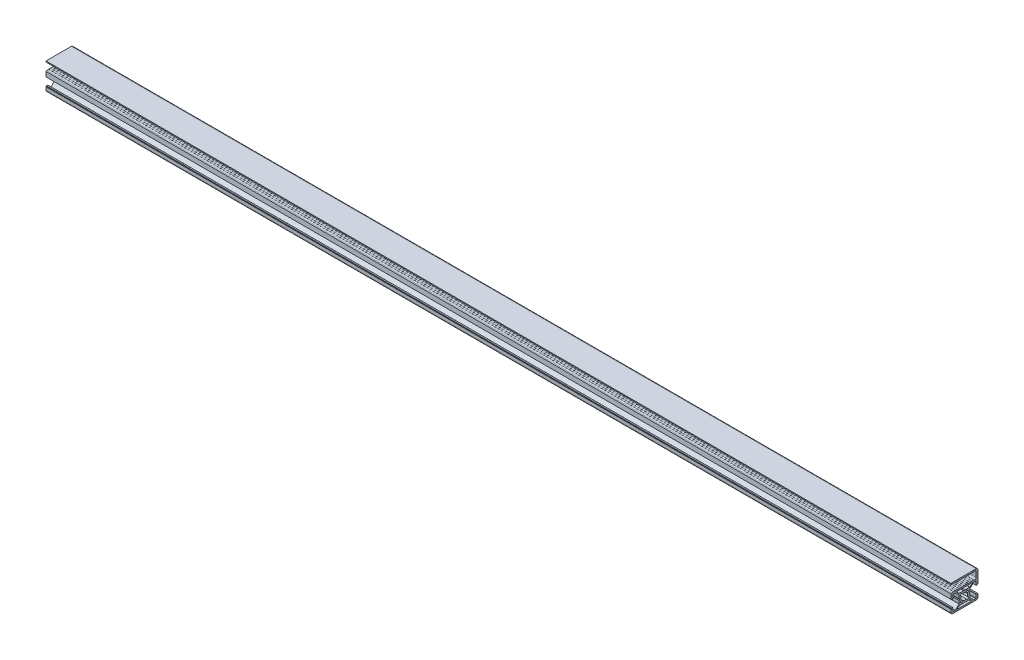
from build123d import *

# Parameters (mm, degrees)
STRUKTURBAUTEIL1_DEPTH = 1000


with BuildPart() as part:
    # Model → Strukturbauteil1 (new body)
    with BuildSketch(Plane(origin=(0, 0, 0), x_dir=(0, 0, -1), z_dir=(1, 0, 0))):
        with BuildLine():
            Line((-15.000004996, 15.000004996), (-15.000004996, 13.900004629))
            Line((-15.000004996, 13.900004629), (-14.000004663, 13.505593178))
            Line((-14.000004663, 13.505593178), (-12.182885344, 13.202725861))
            ThreePointArc((-12.182885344, 13.202725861), (-12.064426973, 13.219237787), (-11.976573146, 13.300396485))
            Line((-11.976573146, 13.300396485), (-11.966223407, 13.319612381))
            ThreePointArc((-11.966223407, 13.319612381), (-11.881055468, 13.399474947), (-11.765808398, 13.418175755))
            Line((-11.765808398, 13.418175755), (-10.176987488, 13.201833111))
            ThreePointArc((-10.176987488, 13.201833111), (-10.061740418, 13.220533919), (-9.976572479, 13.300396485))
            Line((-9.976572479, 13.300396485), (-9.966222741, 13.319612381))
            ThreePointArc((-9.966222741, 13.319612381), (-9.881054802, 13.399474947), (-9.765807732, 13.418175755))
            Line((-9.765807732, 13.418175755), (-8.176986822, 13.201833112))
            ThreePointArc((-8.176986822, 13.201833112), (-8.061739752, 13.220533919), (-7.976571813, 13.300396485))
            Line((-7.976571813, 13.300396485), (-7.966222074, 13.319612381))
            ThreePointArc((-7.966222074, 13.319612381), (-7.881054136, 13.399474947), (-7.765807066, 13.418175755))
            Line((-7.765807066, 13.418175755), (-6.176986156, 13.201833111))
            ThreePointArc((-6.176986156, 13.201833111), (-6.061739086, 13.220533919), (-5.976571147, 13.300396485))
            Line((-5.976571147, 13.300396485), (-5.966221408, 13.319612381))
            ThreePointArc((-5.966221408, 13.319612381), (-5.881053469, 13.399474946), (-5.765806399, 13.418175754))
            Line((-5.765806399, 13.418175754), (-4.17698549, 13.201833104))
            ThreePointArc((-4.17698549, 13.201833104), (-4.06173842, 13.220533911), (-3.976570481, 13.300396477))
            Line((-3.976570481, 13.300396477), (-3.966220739, 13.319612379))
            ThreePointArc((-3.966220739, 13.319612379), (-3.881052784, 13.399474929), (-3.765805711, 13.418175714))
            Line((-3.765805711, 13.418175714), (-2.176984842, 13.201832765))
            ThreePointArc((-2.176984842, 13.201832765), (-2.061737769, 13.22053355), (-1.976569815, 13.3003961))
            Line((-1.976569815, 13.3003961), (-1.966219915, 13.319612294))
            ThreePointArc((-1.966219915, 13.319612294), (-1.881051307, 13.399474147), (-1.765804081, 13.418173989))
            Line((-1.765804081, 13.418173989), (-0.176984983, 13.201818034))
            ThreePointArc((-0.176984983, 13.201818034), (-0.061737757, 13.220517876), (0.023430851, 13.300379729))
            Line((0.023430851, 13.300379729), (0.03378059, 13.319612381))
            ThreePointArc((0.03378059, 13.319612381), (0.118948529, 13.399474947), (0.234195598, 13.418175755))
            Line((0.234195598, 13.418175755), (1.823016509, 13.201833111))
            ThreePointArc((1.823016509, 13.201833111), (1.938263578, 13.220533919), (2.023431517, 13.300396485))
            Line((2.023431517, 13.300396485), (2.033781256, 13.319612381))
            ThreePointArc((2.033781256, 13.319612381), (2.118949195, 13.399474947), (2.234196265, 13.418175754))
            Line((2.234196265, 13.418175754), (3.823017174, 13.201833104))
            ThreePointArc((3.823017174, 13.201833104), (3.938264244, 13.220533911), (4.023432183, 13.300396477))
            Line((4.023432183, 13.300396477), (4.033781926, 13.319612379))
            ThreePointArc((4.033781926, 13.319612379), (4.11894988, 13.399474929), (4.234196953, 13.418175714))
            Line((4.234196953, 13.418175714), (5.823017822, 13.201832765))
            ThreePointArc((5.823017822, 13.201832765), (5.938264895, 13.220533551), (6.023432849, 13.300396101))
            Line((6.023432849, 13.300396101), (6.033782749, 13.319612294))
            ThreePointArc((6.033782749, 13.319612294), (6.118951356, 13.399474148), (6.234198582, 13.418173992))
            Line((6.234198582, 13.418173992), (7.823017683, 13.201818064))
            ThreePointArc((7.823017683, 13.201818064), (7.936103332, 13.219470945), (8.020991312, 13.296243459))
            Line((8.020991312, 13.296243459), (8.031825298, 13.315207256))
            ThreePointArc((8.031825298, 13.315207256), (8.108230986, 13.384055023), (8.209762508, 13.400462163))
            Line((8.209762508, 13.400462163), (9.774792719, 13.201599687))
            ThreePointArc((9.774792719, 13.201599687), (9.932211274, 13.249934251), (10.000003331, 13.400004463))
            Line((10.000003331, 13.400004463), (10.000003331, 13.700004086))
            Line((10.000003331, 13.700004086), (11.300005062, 13.700004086))
            ThreePointArc((11.300005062, 13.700004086), (12.360665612, 13.260664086), (12.800005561, 12.200003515))
            Line((12.800005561, 12.200003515), (12.800005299, 6.700001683))
            ThreePointArc((12.800005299, 6.700001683), (12.360665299, 5.639341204), (11.300004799, 5.200001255))
            Line((11.300004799, 5.200001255), (10.000004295, 5.200001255))
            Line((10.000004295, 5.200001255), (10.000004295, 5.500001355))
            ThreePointArc((10.000004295, 5.500001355), (9.932212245, 5.65007157), (9.774793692, 5.698406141))
            Line((9.774793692, 5.698406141), (8.209763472, 5.49954374))
            ThreePointArc((8.209763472, 5.49954374), (8.108231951, 5.515950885), (8.031826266, 5.584798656))
            Line((8.031826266, 5.584798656), (8.020992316, 5.60374575))
            ThreePointArc((8.020992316, 5.60374575), (7.936104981, 5.680518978), (7.823019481, 5.69817281))
            Line((7.823019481, 5.69817281), (6.23419856, 5.481830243))
            ThreePointArc((6.23419856, 5.481830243), (6.118951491, 5.500531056), (6.033783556, 5.580393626))
            Line((6.033783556, 5.580393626), (6.023433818, 5.599609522))
            ThreePointArc((6.023433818, 5.599609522), (5.938265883, 5.679472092), (5.823018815, 5.698172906))
            Line((5.823018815, 5.698172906), (4.234197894, 5.481830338))
            ThreePointArc((4.234197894, 5.481830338), (4.118950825, 5.500531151), (4.03378289, 5.580393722))
            Line((4.03378289, 5.580393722), (4.023433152, 5.599609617))
            ThreePointArc((4.023433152, 5.599609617), (3.938265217, 5.679472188), (3.823018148, 5.698173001))
            Line((3.823018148, 5.698173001), (2.234197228, 5.481830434))
            ThreePointArc((2.234197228, 5.481830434), (2.118950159, 5.500531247), (2.033782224, 5.580393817))
            Line((2.033782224, 5.580393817), (2.023432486, 5.599609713))
            ThreePointArc((2.023432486, 5.599609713), (1.938264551, 5.679472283), (1.823017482, 5.698173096))
            Line((1.823017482, 5.698173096), (0.234196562, 5.481830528))
            ThreePointArc((0.234196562, 5.481830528), (0.118949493, 5.500531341), (0.033781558, 5.580393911))
            Line((0.033781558, 5.580393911), (0.023431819, 5.599609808))
            ThreePointArc((0.023431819, 5.599609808), (-0.061736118, 5.679472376), (-0.176983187, 5.698173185))
            Line((-0.176983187, 5.698173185), (-1.765804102, 5.48183057))
            ThreePointArc((-1.765804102, 5.48183057), (-1.881051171, 5.500531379), (-1.966219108, 5.580393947))
            Line((-1.966219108, 5.580393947), (-1.976568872, 5.59960989))
            ThreePointArc((-1.976568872, 5.59960989), (-2.061736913, 5.679472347), (-2.176984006, 5.698173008))
            Line((-2.176984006, 5.698173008), (-3.76580464, 5.481828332))
            ThreePointArc((-3.76580464, 5.481828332), (-3.881051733, 5.500528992), (-3.966219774, 5.580391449))
            Line((-3.966219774, 5.580391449), (-3.97657062, 5.599609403))
            ThreePointArc((-3.97657062, 5.599609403), (-4.06174316, 5.679467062), (-4.176991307, 5.69816123))
            Line((-4.176991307, 5.69816123), (-5.76579975, 5.481727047))
            ThreePointArc((-5.76579975, 5.481727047), (-5.881047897, 5.500421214), (-5.966220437, 5.580278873))
            Line((-5.966220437, 5.580278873), (-5.976570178, 5.599610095))
            ThreePointArc((-5.976570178, 5.599610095), (-6.061738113, 5.679472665), (-6.176985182, 5.698173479))
            Line((-6.176985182, 5.698173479), (-7.765806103, 5.481830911))
            ThreePointArc((-7.765806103, 5.481830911), (-7.881053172, 5.500531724), (-7.966221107, 5.580394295))
            Line((-7.966221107, 5.580394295), (-7.976570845, 5.599610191))
            ThreePointArc((-7.976570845, 5.599610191), (-8.061738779, 5.679472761), (-8.176985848, 5.698173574))
            Line((-8.176985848, 5.698173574), (-9.765806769, 5.481831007))
            ThreePointArc((-9.765806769, 5.481831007), (-9.881053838, 5.50053182), (-9.966221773, 5.58039439))
            Line((-9.966221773, 5.58039439), (-9.976571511, 5.599610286))
            ThreePointArc((-9.976571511, 5.599610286), (-10.061739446, 5.679472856), (-10.176986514, 5.698173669))
            Line((-10.176986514, 5.698173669), (-11.765807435, 5.4818311))
            ThreePointArc((-11.765807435, 5.4818311), (-11.881054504, 5.500531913), (-11.966222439, 5.580394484))
            Line((-11.966222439, 5.580394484), (-11.976572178, 5.599610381))
            ThreePointArc((-11.976572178, 5.599610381), (-12.064426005, 5.68076908), (-12.182884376, 5.697281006))
            Line((-12.182884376, 5.697281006), (-14.000003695, 5.394413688))
            Line((-14.000003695, 5.394413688), (-15.000004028, 5.000002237))
            Line((-15.000004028, 5.000002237), (-15.000004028, -0.299999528))
            Line((-15.000004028, -0.299999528), (-14.400003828, -0.299999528))
            Line((-14.400003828, -0.299999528), (-14.400003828, -0.899999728))
            Line((-14.400003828, -0.899999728), (-13.000003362, -0.899999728))
            ThreePointArc((-13.000003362, -0.899999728), (-12.858581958, -0.841421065), (-12.800003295, -0.699999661))
            Line((-12.800003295, -0.699999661), (-12.800003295, 3.150001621))
            ThreePointArc((-12.800003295, 3.150001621), (-12.741424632, 3.291423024), (-12.600003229, 3.350001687))
            Line((-12.600003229, 3.350001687), (-10.232845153, 3.350001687))
            ThreePointArc((-10.232845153, 3.350001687), (-10.156308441, 3.334777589), (-10.091423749, 3.291423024))
            Line((-10.091423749, 3.291423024), (-6.008579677, -0.791421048))
            ThreePointArc((-6.008579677, -0.791421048), (-5.965225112, -0.856305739), (-5.950001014, -0.932842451))
            Line((-5.950001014, -0.932842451), (-5.950001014, -4.139383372))
            Line((-5.950001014, -4.139383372), (-5.45312314, -5.000001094))
            Line((-5.45312314, -5.000001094), (-5.950001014, -5.860618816))
            Line((-5.950001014, -5.860618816), (-5.950001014, -9.067159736))
            ThreePointArc((-5.950001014, -9.067159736), (-5.965225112, -9.143696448), (-6.008579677, -9.208581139))
            Line((-6.008579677, -9.208581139), (-10.091423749, -13.291425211))
            ThreePointArc((-10.091423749, -13.291425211), (-10.156308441, -13.334779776), (-10.232845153, -13.350003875))
            Line((-10.232845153, -13.350003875), (-12.600003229, -13.350003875))
            ThreePointArc((-12.600003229, -13.350003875), (-12.741424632, -13.291425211), (-12.800003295, -13.150003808))
            Line((-12.800003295, -13.150003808), (-12.800003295, -9.300002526))
            ThreePointArc((-12.800003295, -9.300002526), (-12.858581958, -9.158581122), (-13.000003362, -9.100002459))
            Line((-13.000003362, -9.100002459), (-14.400003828, -9.100002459))
            Line((-14.400003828, -9.100002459), (-14.400003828, -9.700002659))
            Line((-14.400003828, -9.700002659), (-15.000004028, -9.700002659))
            Line((-15.000004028, -9.700002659), (-15.000004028, -13.000003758))
            ThreePointArc((-15.000004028, -13.000003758), (-14.414217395, -14.414217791), (-13.000003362, -15.000004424))
            Line((-13.000003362, -15.000004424), (13.000005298, -15.000004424))
            ThreePointArc((13.000005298, -15.000004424), (14.414219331, -14.414217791), (15.000005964, -13.000003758))
            Line((15.000005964, -13.000003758), (15.000005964, -9.700002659))
            Line((15.000005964, -9.700002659), (14.400005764, -9.700002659))
            Line((14.400005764, -9.700002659), (14.400005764, -9.100002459))
            Line((14.400005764, -9.100002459), (13.000005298, -9.100002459))
            ThreePointArc((13.000005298, -9.100002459), (12.858583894, -9.158581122), (12.800005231, -9.300002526))
            Line((12.800005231, -9.300002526), (12.800005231, -13.150003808))
            ThreePointArc((12.800005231, -13.150003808), (12.741426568, -13.291425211), (12.600005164, -13.350003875))
            Line((12.600005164, -13.350003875), (10.232847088, -13.350003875))
            ThreePointArc((10.232847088, -13.350003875), (10.156310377, -13.334779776), (10.091425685, -13.291425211))
            Line((10.091425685, -13.291425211), (6.008581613, -9.208581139))
            ThreePointArc((6.008581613, -9.208581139), (5.965227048, -9.143696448), (5.95000295, -9.067159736))
            Line((5.95000295, -9.067159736), (5.95000295, -5.860618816))
            Line((5.95000295, -5.860618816), (5.453125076, -5.000001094))
            Line((5.453125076, -5.000001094), (5.95000295, -4.139383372))
            Line((5.95000295, -4.139383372), (5.95000295, -0.932842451))
            ThreePointArc((5.95000295, -0.932842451), (5.965227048, -0.856305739), (6.008581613, -0.791421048))
            Line((6.008581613, -0.791421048), (10.091425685, 3.291423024))
            ThreePointArc((10.091425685, 3.291423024), (10.156310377, 3.334777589), (10.232847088, 3.350001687))
            Line((10.232847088, 3.350001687), (12.600005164, 3.350001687))
            ThreePointArc((12.600005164, 3.350001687), (12.741426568, 3.291423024), (12.800005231, 3.150001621))
            Line((12.800005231, 3.150001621), (12.800005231, -0.699999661))
            ThreePointArc((12.800005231, -0.699999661), (12.858583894, -0.841421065), (13.000005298, -0.899999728))
            Line((13.000005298, -0.899999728), (14.400005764, -0.899999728))
            Line((14.400005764, -0.899999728), (14.400005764, -0.299999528))
            Line((14.400005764, -0.299999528), (15.000004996, -0.299999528))
            Line((15.000004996, -0.299999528), (15.000004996, 13.00000433))
            ThreePointArc((15.000004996, 13.00000433), (14.414218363, 14.414218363), (13.00000433, 15.000004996))
            Line((13.00000433, 15.000004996), (-15.000004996, 15.000004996))
        make_face()
        with BuildLine():
            Line((-7.864037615, -13.350004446), (7.864037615, -13.350004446))
            ThreePointArc((7.864037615, -13.350004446), (8.048813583, -13.226541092), (8.005459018, -13.008582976))
            Line((8.005459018, -13.008582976), (6.008580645, -11.011704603))
            ThreePointArc((6.008580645, -11.011704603), (5.943695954, -10.968350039), (5.867159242, -10.95312594))
            Line((5.867159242, -10.95312594), (0.866025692, -10.95312594))
            Line((0.866025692, -10.95312594), (0, -10.453125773))
            Line((0, -10.453125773), (-0.866025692, -10.95312594))
            Line((-0.866025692, -10.95312594), (-5.867159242, -10.95312594))
            ThreePointArc((-5.867159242, -10.95312594), (-5.943695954, -10.968350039), (-6.008580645, -11.011704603))
            Line((-6.008580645, -11.011704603), (-8.005459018, -13.008582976))
            ThreePointArc((-8.005459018, -13.008582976), (-8.048813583, -13.226541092), (-7.864037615, -13.350004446))
        make_face(mode=Mode.SUBTRACT)
        with BuildLine():
            Line((-4.531372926, -1.882842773), (-3.18929438, -3.224921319))
            ThreePointArc((-3.18929438, -3.224921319), (-3.650001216, -5.000001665), (-3.18929438, -6.775082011))
            Line((-3.18929438, -6.775082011), (-4.531372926, -8.117160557))
            ThreePointArc((-4.531372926, -8.117160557), (-3.889088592, -8.889090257), (-3.117158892, -9.531374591))
            Line((-3.117158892, -9.531374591), (-1.775080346, -8.189296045))
            ThreePointArc((-1.775080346, -8.189296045), (0, -8.650002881), (1.775080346, -8.189296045))
            Line((1.775080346, -8.189296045), (3.117158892, -9.531374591))
            ThreePointArc((3.117158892, -9.531374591), (3.889088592, -8.889090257), (4.531372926, -8.117160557))
            Line((4.531372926, -8.117160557), (3.18929438, -6.775082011))
            ThreePointArc((3.18929438, -6.775082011), (3.650001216, -5.000001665), (3.18929438, -3.224921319))
            Line((3.18929438, -3.224921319), (4.531372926, -1.882842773))
            ThreePointArc((4.531372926, -1.882842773), (3.889088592, -1.110913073), (3.117158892, -0.46862874))
            Line((3.117158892, -0.46862874), (1.775080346, -1.810707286))
            ThreePointArc((1.775080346, -1.810707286), (0, -1.35000045), (-1.775080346, -1.810707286))
            Line((-1.775080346, -1.810707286), (-3.117158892, -0.46862874))
            ThreePointArc((-3.117158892, -0.46862874), (-3.889088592, -1.110913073), (-4.531372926, -1.882842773))
        make_face(mode=Mode.SUBTRACT)
        with BuildLine():
            Line((-8.601703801, 3.598579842), (-6.008580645, 1.005456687))
            ThreePointArc((-6.008580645, 1.005456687), (-5.943695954, 0.962102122), (-5.867159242, 0.946878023))
            Line((-5.867159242, 0.946878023), (-0.855209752, 0.946878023))
            Line((-0.855209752, 0.946878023), (0, 0.453122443))
            Line((0, 0.453122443), (0.855209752, 0.946878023))
            Line((0.855209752, 0.946878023), (5.867159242, 0.946878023))
            ThreePointArc((5.867159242, 0.946878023), (5.943695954, 0.962102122), (6.008580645, 1.005456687))
            Line((6.008580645, 1.005456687), (8.601703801, 3.598579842))
            ThreePointArc((8.601703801, 3.598579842), (8.645058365, 3.816537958), (8.460282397, 3.940001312))
            Line((8.460282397, 3.940001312), (-8.460282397, 3.940001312))
            ThreePointArc((-8.460282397, 3.940001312), (-8.645058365, 3.816537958), (-8.601703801, 3.598579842))
        make_face(mode=Mode.SUBTRACT)
    extrude(amount=STRUKTURBAUTEIL1_DEPTH)


solid = part.part
